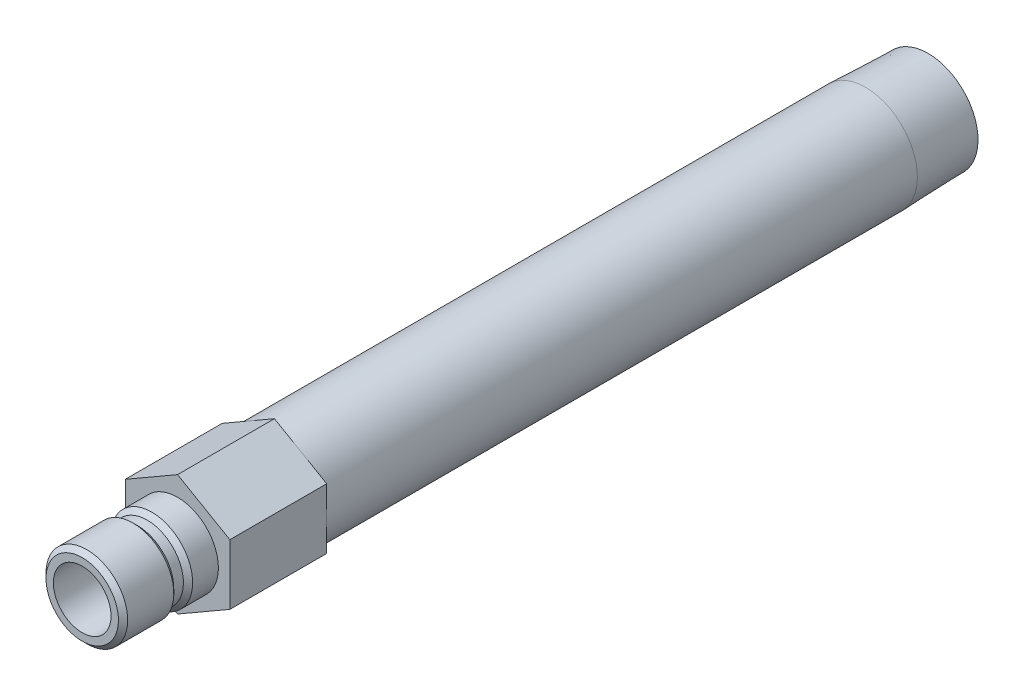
ISO-10303-21;
HEADER;
FILE_DESCRIPTION(('STEP AP214'),'2;1');
FILE_NAME('part.step','',(''),(''),'','','');
FILE_SCHEMA(('AUTOMOTIVE_DESIGN { 1 0 10303 214 1 1 1 1 }'));
ENDSEC;
DATA;
#1=APPLICATION_CONTEXT('core data for automotive mechanical design processes');
#2=APPLICATION_PROTOCOL_DEFINITION('international standard','automotive_design',2000,#1);
#3=PRODUCT_CONTEXT('',#1,'mechanical');
#4=PRODUCT('Part','Part','',(#3));
#5=PRODUCT_RELATED_PRODUCT_CATEGORY('part','',(#4));
#6=PRODUCT_DEFINITION_FORMATION('','',#4);
#7=PRODUCT_DEFINITION_CONTEXT('part definition',#1,'design');
#8=PRODUCT_DEFINITION('design','',#6,#7);
#9=PRODUCT_DEFINITION_SHAPE('','',#8);
#10=(LENGTH_UNIT() NAMED_UNIT(*) SI_UNIT(.MILLI.,.METRE.));
#11=(NAMED_UNIT(*) PLANE_ANGLE_UNIT() SI_UNIT($,.RADIAN.));
#12=(NAMED_UNIT(*) SI_UNIT($,.STERADIAN.) SOLID_ANGLE_UNIT());
#13=UNCERTAINTY_MEASURE_WITH_UNIT(LENGTH_MEASURE(1.E-05),#10,'distance_accuracy_value','');
#14=(GEOMETRIC_REPRESENTATION_CONTEXT(3) GLOBAL_UNCERTAINTY_ASSIGNED_CONTEXT((#13)) GLOBAL_UNIT_ASSIGNED_CONTEXT((#10,
#11,#12)) REPRESENTATION_CONTEXT('',''));
#15=CARTESIAN_POINT('',(0.,0.,0.));
#16=DIRECTION('',(0.,0.,1.));
#17=DIRECTION('',(1.,0.,0.));
#18=AXIS2_PLACEMENT_3D('',#15,#16,#17);
#19=CARTESIAN_POINT('',(0.,0.,0.));
#20=DIRECTION('',(0.,0.,-1.));
#21=DIRECTION('',(0.,1.,0.));
#22=AXIS2_PLACEMENT_3D('',#19,#20,#21);
#23=CYLINDRICAL_SURFACE('',#22,8.57249999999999);
#24=CARTESIAN_POINT('',(0.,0.,-113.6142));
#25=DIRECTION('',(0.,0.,-1.));
#26=DIRECTION('',(0.,1.,0.));
#27=AXIS2_PLACEMENT_3D('',#24,#25,#26);
#28=CIRCLE('',#27,8.57249999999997);
#29=CARTESIAN_POINT('',(0.,8.5725,-113.6142));
#30=VERTEX_POINT('',#29);
#31=EDGE_CURVE('E168',#30,#30,#28,.T.);
#32=ORIENTED_EDGE('',*,*,#31,.F.);
#33=EDGE_LOOP('',(#32));
#34=FACE_BOUND('',#33,.T.);
#35=CARTESIAN_POINT('',(0.,0.,-16.002));
#36=DIRECTION('',(0.,0.,1.));
#37=DIRECTION('',(1.,0.,0.));
#38=AXIS2_PLACEMENT_3D('',#35,#36,#37);
#39=CIRCLE('',#38,8.57249999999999);
#40=CARTESIAN_POINT('',(8.57249999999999,0.,-16.002));
#41=VERTEX_POINT('',#40);
#42=EDGE_CURVE('E37',#41,#41,#39,.F.);
#43=ORIENTED_EDGE('',*,*,#42,.T.);
#44=EDGE_LOOP('',(#43));
#45=FACE_BOUND('',#44,.T.);
#46=ADVANCED_FACE('F33',(#34,#45),#23,.T.);
#47=CARTESIAN_POINT('',(0.,0.,0.));
#48=DIRECTION('',(0.,0.,-1.));
#49=DIRECTION('',(0.,1.,0.));
#50=AXIS2_PLACEMENT_3D('',#47,#48,#49);
#51=CYLINDRICAL_SURFACE('',#50,4.7625);
#52=CARTESIAN_POINT('',(0.,0.,15.748));
#53=DIRECTION('',(0.,0.,-1.));
#54=DIRECTION('',(0.,1.,0.));
#55=AXIS2_PLACEMENT_3D('',#52,#53,#54);
#56=CIRCLE('',#55,4.7625);
#57=CARTESIAN_POINT('',(0.,4.7625,15.748));
#58=VERTEX_POINT('',#57);
#59=EDGE_CURVE('E144',#58,#58,#56,.T.);
#60=ORIENTED_EDGE('',*,*,#59,.F.);
#61=EDGE_LOOP('',(#60));
#62=FACE_BOUND('',#61,.T.);
#63=CARTESIAN_POINT('',(0.,0.,-16.002));
#64=DIRECTION('',(0.,0.,-1.));
#65=DIRECTION('',(0.,1.,0.));
#66=AXIS2_PLACEMENT_3D('',#63,#64,#65);
#67=CIRCLE('',#66,4.76249999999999);
#68=CARTESIAN_POINT('',(0.,4.7625,-16.002));
#69=VERTEX_POINT('',#68);
#70=EDGE_CURVE('E11',#69,#69,#67,.T.);
#71=ORIENTED_EDGE('',*,*,#70,.T.);
#72=EDGE_LOOP('',(#71));
#73=FACE_BOUND('',#72,.T.);
#74=ADVANCED_FACE('F35',(#62,#73),#51,.F.);
#75=CARTESIAN_POINT('',(0.,4.7625,-16.002));
#76=DIRECTION('',(0.,0.,-1.));
#77=DIRECTION('',(0.,1.,0.));
#78=AXIS2_PLACEMENT_3D('',#75,#76,#77);
#79=PLANE('',#78);
#80=CARTESIAN_POINT('',(0.,0.,-16.002));
#81=DIRECTION('',(0.,0.,-1.));
#82=DIRECTION('',(0.,1.,0.));
#83=AXIS2_PLACEMENT_3D('',#80,#81,#82);
#84=CIRCLE('',#83,6.26109999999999);
#85=CARTESIAN_POINT('',(0.,6.2611,-16.002));
#86=VERTEX_POINT('',#85);
#87=EDGE_CURVE('E43',#86,#86,#84,.T.);
#88=ORIENTED_EDGE('',*,*,#87,.T.);
#89=EDGE_LOOP('',(#88));
#90=FACE_BOUND('',#89,.T.);
#91=ORIENTED_EDGE('',*,*,#70,.F.);
#92=EDGE_LOOP('',(#91));
#93=FACE_BOUND('',#92,.T.);
#94=ADVANCED_FACE('F180',(#90,#93),#79,.T.);
#95=CARTESIAN_POINT('',(0.,0.,0.));
#96=DIRECTION('',(0.,0.,-1.));
#97=DIRECTION('',(0.,1.,0.));
#98=AXIS2_PLACEMENT_3D('',#95,#96,#97);
#99=CYLINDRICAL_SURFACE('',#98,6.26109999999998);
#100=CARTESIAN_POINT('',(0.,0.,-123.952));
#101=DIRECTION('',(0.,0.,-1.));
#102=DIRECTION('',(0.,1.,0.));
#103=AXIS2_PLACEMENT_3D('',#100,#101,#102);
#104=CIRCLE('',#103,6.26109999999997);
#105=CARTESIAN_POINT('',(0.,6.2611,-123.952));
#106=VERTEX_POINT('',#105);
#107=EDGE_CURVE('E174',#106,#106,#104,.T.);
#108=ORIENTED_EDGE('',*,*,#107,.T.);
#109=EDGE_LOOP('',(#108));
#110=FACE_BOUND('',#109,.T.);
#111=ORIENTED_EDGE('',*,*,#87,.F.);
#112=EDGE_LOOP('',(#111));
#113=FACE_BOUND('',#112,.T.);
#114=ADVANCED_FACE('F183',(#110,#113),#99,.F.);
#115=CARTESIAN_POINT('',(0.,8.24944566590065,-123.952));
#116=DIRECTION('',(0.,0.,-1.));
#117=DIRECTION('',(0.,1.,0.));
#118=AXIS2_PLACEMENT_3D('',#115,#116,#117);
#119=PLANE('',#118);
#120=CARTESIAN_POINT('',(0.,0.,-123.952));
#121=DIRECTION('',(0.,0.,-1.));
#122=DIRECTION('',(0.,1.,0.));
#123=AXIS2_PLACEMENT_3D('',#120,#121,#122);
#124=CIRCLE('',#123,8.24944566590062);
#125=CARTESIAN_POINT('',(0.,8.24944566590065,-123.952));
#126=VERTEX_POINT('',#125);
#127=EDGE_CURVE('E171',#126,#126,#124,.T.);
#128=ORIENTED_EDGE('',*,*,#127,.T.);
#129=EDGE_LOOP('',(#128));
#130=FACE_BOUND('',#129,.T.);
#131=ORIENTED_EDGE('',*,*,#107,.F.);
#132=EDGE_LOOP('',(#131));
#133=FACE_BOUND('',#132,.T.);
#134=ADVANCED_FACE('F185',(#130,#133),#119,.T.);
#135=CARTESIAN_POINT('',(0.,0.,-123.952));
#136=DIRECTION('',(0.,0.,1.));
#137=DIRECTION('',(0.,-1.,0.));
#138=AXIS2_PLACEMENT_3D('',#135,#136,#137);
#139=CONICAL_SURFACE('',#138,8.24944566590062,0.0312396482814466);
#140=ORIENTED_EDGE('',*,*,#31,.T.);
#141=EDGE_LOOP('',(#140));
#142=FACE_BOUND('',#141,.T.);
#143=ORIENTED_EDGE('',*,*,#127,.F.);
#144=EDGE_LOOP('',(#143));
#145=FACE_BOUND('',#144,.T.);
#146=ADVANCED_FACE('F192',(#142,#145),#139,.T.);
#147=CARTESIAN_POINT('',(0.,6.7437,0.));
#148=DIRECTION('',(0.,0.,1.));
#149=DIRECTION('',(0.,-1.,0.));
#150=AXIS2_PLACEMENT_3D('',#147,#148,#149);
#151=PLANE('',#150);
#152=CARTESIAN_POINT('',(0.,0.,0.));
#153=DIRECTION('',(0.,0.,-1.));
#154=DIRECTION('',(0.,1.,0.));
#155=AXIS2_PLACEMENT_3D('',#152,#153,#154);
#156=CIRCLE('',#155,6.7437);
#157=CARTESIAN_POINT('',(0.,6.7437,0.));
#158=VERTEX_POINT('',#157);
#159=EDGE_CURVE('E165',#158,#158,#156,.T.);
#160=ORIENTED_EDGE('',*,*,#159,.T.);
#161=EDGE_LOOP('',(#160));
#162=FACE_BOUND('',#161,.T.);
#163=DIRECTION('',(-0.866025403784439,-0.5,0.));
#164=VECTOR('',#163,1.);
#165=CARTESIAN_POINT('',(0.,9.97199384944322,0.));
#166=LINE('',#165,#164);
#167=CARTESIAN_POINT('',(0.,9.97199384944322,0.));
#168=VERTEX_POINT('',#167);
#169=CARTESIAN_POINT('',(-8.636,4.98599692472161,0.));
#170=VERTEX_POINT('',#169);
#171=EDGE_CURVE('E122',#168,#170,#166,.T.);
#172=ORIENTED_EDGE('',*,*,#171,.T.);
#173=DIRECTION('',(0.,-1.,0.));
#174=VECTOR('',#173,1.);
#175=CARTESIAN_POINT('',(-8.636,4.98599692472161,0.));
#176=LINE('',#175,#174);
#177=CARTESIAN_POINT('',(-8.636,-4.98599692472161,0.));
#178=VERTEX_POINT('',#177);
#179=EDGE_CURVE('E125',#170,#178,#176,.T.);
#180=ORIENTED_EDGE('',*,*,#179,.T.);
#181=DIRECTION('',(0.866025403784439,-0.5,0.));
#182=VECTOR('',#181,1.);
#183=CARTESIAN_POINT('',(-8.636,-4.98599692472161,0.));
#184=LINE('',#183,#182);
#185=CARTESIAN_POINT('',(0.,-9.97199384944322,0.));
#186=VERTEX_POINT('',#185);
#187=EDGE_CURVE('E128',#178,#186,#184,.T.);
#188=ORIENTED_EDGE('',*,*,#187,.T.);
#189=DIRECTION('',(0.866025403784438,0.5,0.));
#190=VECTOR('',#189,1.);
#191=CARTESIAN_POINT('',(0.,-9.97199384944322,0.));
#192=LINE('',#191,#190);
#193=CARTESIAN_POINT('',(8.63599999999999,-4.98599692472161,0.));
#194=VERTEX_POINT('',#193);
#195=EDGE_CURVE('E131',#186,#194,#192,.T.);
#196=ORIENTED_EDGE('',*,*,#195,.T.);
#197=DIRECTION('',(0.,1.,0.));
#198=VECTOR('',#197,1.);
#199=CARTESIAN_POINT('',(8.63599999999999,-4.98599692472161,0.));
#200=LINE('',#199,#198);
#201=CARTESIAN_POINT('',(8.636,4.98599692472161,0.));
#202=VERTEX_POINT('',#201);
#203=EDGE_CURVE('E99',#194,#202,#200,.T.);
#204=ORIENTED_EDGE('',*,*,#203,.T.);
#205=DIRECTION('',(-0.866025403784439,0.5,0.));
#206=VECTOR('',#205,1.);
#207=CARTESIAN_POINT('',(8.636,4.98599692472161,0.));
#208=LINE('',#207,#206);
#209=EDGE_CURVE('E134',#202,#168,#208,.T.);
#210=ORIENTED_EDGE('',*,*,#209,.T.);
#211=EDGE_LOOP('',(#172,#180,#188,#196,#204,#210));
#212=FACE_BOUND('',#211,.T.);
#213=ADVANCED_FACE('F206',(#162,#212),#151,.T.);
#214=CARTESIAN_POINT('',(0.,0.,0.));
#215=DIRECTION('',(0.,0.,-1.));
#216=DIRECTION('',(0.,1.,0.));
#217=AXIS2_PLACEMENT_3D('',#214,#215,#216);
#218=CYLINDRICAL_SURFACE('',#217,6.7437);
#219=CARTESIAN_POINT('',(0.,0.,4.25449999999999));
#220=DIRECTION('',(0.,0.,-1.));
#221=DIRECTION('',(0.,1.,0.));
#222=AXIS2_PLACEMENT_3D('',#219,#220,#221);
#223=CIRCLE('',#222,6.7437);
#224=CARTESIAN_POINT('',(0.,6.7437,4.2545));
#225=VERTEX_POINT('',#224);
#226=EDGE_CURVE('E162',#225,#225,#223,.T.);
#227=ORIENTED_EDGE('',*,*,#226,.T.);
#228=EDGE_LOOP('',(#227));
#229=FACE_BOUND('',#228,.T.);
#230=ORIENTED_EDGE('',*,*,#159,.F.);
#231=EDGE_LOOP('',(#230));
#232=FACE_BOUND('',#231,.T.);
#233=ADVANCED_FACE('F213',(#229,#232),#218,.T.);
#234=CARTESIAN_POINT('',(0.,0.,4.25449999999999));
#235=DIRECTION('',(0.,0.,-1.));
#236=DIRECTION('',(0.,1.,0.));
#237=AXIS2_PLACEMENT_3D('',#234,#235,#236);
#238=CONICAL_SURFACE('',#237,6.7437,0.785398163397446);
#239=CARTESIAN_POINT('',(0.,0.,5.0165));
#240=DIRECTION('',(0.,0.,-1.));
#241=DIRECTION('',(0.,1.,0.));
#242=AXIS2_PLACEMENT_3D('',#239,#240,#241);
#243=CIRCLE('',#242,5.9817);
#244=CARTESIAN_POINT('',(0.,5.9817,5.0165));
#245=VERTEX_POINT('',#244);
#246=EDGE_CURVE('E159',#245,#245,#243,.T.);
#247=ORIENTED_EDGE('',*,*,#246,.T.);
#248=EDGE_LOOP('',(#247));
#249=FACE_BOUND('',#248,.T.);
#250=ORIENTED_EDGE('',*,*,#226,.F.);
#251=EDGE_LOOP('',(#250));
#252=FACE_BOUND('',#251,.T.);
#253=ADVANCED_FACE('F222',(#249,#252),#238,.T.);
#254=CARTESIAN_POINT('',(0.,0.,0.));
#255=DIRECTION('',(0.,0.,-1.));
#256=DIRECTION('',(0.,1.,0.));
#257=AXIS2_PLACEMENT_3D('',#254,#255,#256);
#258=CYLINDRICAL_SURFACE('',#257,5.9817);
#259=CARTESIAN_POINT('',(0.,0.,6.604));
#260=DIRECTION('',(0.,0.,-1.));
#261=DIRECTION('',(0.,1.,0.));
#262=AXIS2_PLACEMENT_3D('',#259,#260,#261);
#263=CIRCLE('',#262,5.9817);
#264=CARTESIAN_POINT('',(0.,5.9817,6.604));
#265=VERTEX_POINT('',#264);
#266=EDGE_CURVE('E156',#265,#265,#263,.T.);
#267=ORIENTED_EDGE('',*,*,#266,.T.);
#268=EDGE_LOOP('',(#267));
#269=FACE_BOUND('',#268,.T.);
#270=ORIENTED_EDGE('',*,*,#246,.F.);
#271=EDGE_LOOP('',(#270));
#272=FACE_BOUND('',#271,.T.);
#273=ADVANCED_FACE('F263',(#269,#272),#258,.T.);
#274=CARTESIAN_POINT('',(0.,0.,6.604));
#275=DIRECTION('',(0.,0.,1.));
#276=DIRECTION('',(0.,-1.,0.));
#277=AXIS2_PLACEMENT_3D('',#274,#275,#276);
#278=CONICAL_SURFACE('',#277,5.9817,0.785398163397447);
#279=CARTESIAN_POINT('',(0.,0.,7.366));
#280=DIRECTION('',(0.,0.,-1.));
#281=DIRECTION('',(0.,1.,0.));
#282=AXIS2_PLACEMENT_3D('',#279,#280,#281);
#283=CIRCLE('',#282,6.7437);
#284=CARTESIAN_POINT('',(0.,6.7437,7.366));
#285=VERTEX_POINT('',#284);
#286=EDGE_CURVE('E153',#285,#285,#283,.T.);
#287=ORIENTED_EDGE('',*,*,#286,.T.);
#288=EDGE_LOOP('',(#287));
#289=FACE_BOUND('',#288,.T.);
#290=ORIENTED_EDGE('',*,*,#266,.F.);
#291=EDGE_LOOP('',(#290));
#292=FACE_BOUND('',#291,.T.);
#293=ADVANCED_FACE('F259',(#289,#292),#278,.T.);
#294=CARTESIAN_POINT('',(0.,0.,0.));
#295=DIRECTION('',(0.,0.,-1.));
#296=DIRECTION('',(0.,1.,0.));
#297=AXIS2_PLACEMENT_3D('',#294,#295,#296);
#298=CYLINDRICAL_SURFACE('',#297,6.7437);
#299=CARTESIAN_POINT('',(0.,0.,14.986));
#300=DIRECTION('',(0.,0.,-1.));
#301=DIRECTION('',(0.,1.,0.));
#302=AXIS2_PLACEMENT_3D('',#299,#300,#301);
#303=CIRCLE('',#302,6.7437);
#304=CARTESIAN_POINT('',(0.,6.7437,14.986));
#305=VERTEX_POINT('',#304);
#306=EDGE_CURVE('E150',#305,#305,#303,.T.);
#307=ORIENTED_EDGE('',*,*,#306,.T.);
#308=EDGE_LOOP('',(#307));
#309=FACE_BOUND('',#308,.T.);
#310=ORIENTED_EDGE('',*,*,#286,.F.);
#311=EDGE_LOOP('',(#310));
#312=FACE_BOUND('',#311,.T.);
#313=ADVANCED_FACE('F255',(#309,#312),#298,.T.);
#314=CARTESIAN_POINT('',(0.,0.,14.986));
#315=DIRECTION('',(0.,0.,-1.));
#316=DIRECTION('',(0.,1.,0.));
#317=AXIS2_PLACEMENT_3D('',#314,#315,#316);
#318=CONICAL_SURFACE('',#317,6.7437,0.785398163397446);
#319=CARTESIAN_POINT('',(0.,0.,15.748));
#320=DIRECTION('',(0.,0.,-1.));
#321=DIRECTION('',(0.,1.,0.));
#322=AXIS2_PLACEMENT_3D('',#319,#320,#321);
#323=CIRCLE('',#322,5.9817);
#324=CARTESIAN_POINT('',(0.,5.9817,15.748));
#325=VERTEX_POINT('',#324);
#326=EDGE_CURVE('E147',#325,#325,#323,.T.);
#327=ORIENTED_EDGE('',*,*,#326,.T.);
#328=EDGE_LOOP('',(#327));
#329=FACE_BOUND('',#328,.T.);
#330=ORIENTED_EDGE('',*,*,#306,.F.);
#331=EDGE_LOOP('',(#330));
#332=FACE_BOUND('',#331,.T.);
#333=ADVANCED_FACE('F251',(#329,#332),#318,.T.);
#334=CARTESIAN_POINT('',(0.,4.7625,15.748));
#335=DIRECTION('',(0.,0.,1.));
#336=DIRECTION('',(0.,-1.,0.));
#337=AXIS2_PLACEMENT_3D('',#334,#335,#336);
#338=PLANE('',#337);
#339=ORIENTED_EDGE('',*,*,#59,.T.);
#340=EDGE_LOOP('',(#339));
#341=FACE_BOUND('',#340,.T.);
#342=ORIENTED_EDGE('',*,*,#326,.F.);
#343=EDGE_LOOP('',(#342));
#344=FACE_BOUND('',#343,.T.);
#345=ADVANCED_FACE('F239',(#341,#344),#338,.T.);
#346=CARTESIAN_POINT('',(0.,9.97199384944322,-16.002));
#347=DIRECTION('',(-0.5,0.866025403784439,0.));
#348=DIRECTION('',(-0.866025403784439,-0.5,0.));
#349=AXIS2_PLACEMENT_3D('',#346,#347,#348);
#350=PLANE('',#349);
#351=ORIENTED_EDGE('',*,*,#171,.F.);
#352=DIRECTION('',(0.,0.,1.));
#353=VECTOR('',#352,1.);
#354=CARTESIAN_POINT('',(0.,9.97199384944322,-16.002));
#355=LINE('',#354,#353);
#356=CARTESIAN_POINT('',(0.,9.97199384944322,-16.002));
#357=VERTEX_POINT('',#356);
#358=EDGE_CURVE('E51',#357,#168,#355,.T.);
#359=ORIENTED_EDGE('',*,*,#358,.F.);
#360=DIRECTION('',(-0.866025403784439,-0.5,0.));
#361=VECTOR('',#360,1.);
#362=CARTESIAN_POINT('',(0.,9.97199384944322,-16.002));
#363=LINE('',#362,#361);
#364=CARTESIAN_POINT('',(-8.636,4.98599692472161,-16.002));
#365=VERTEX_POINT('',#364);
#366=EDGE_CURVE('E137',#357,#365,#363,.T.);
#367=ORIENTED_EDGE('',*,*,#366,.T.);
#368=DIRECTION('',(0.,0.,1.));
#369=VECTOR('',#368,1.);
#370=CARTESIAN_POINT('',(-8.636,4.98599692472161,-16.002));
#371=LINE('',#370,#369);
#372=EDGE_CURVE('E86',#365,#170,#371,.T.);
#373=ORIENTED_EDGE('',*,*,#372,.T.);
#374=EDGE_LOOP('',(#351,#359,#367,#373));
#375=FACE_BOUND('',#374,.T.);
#376=ADVANCED_FACE('F226',(#375),#350,.T.);
#377=CARTESIAN_POINT('',(8.636,4.98599692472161,-16.002));
#378=DIRECTION('',(0.5,0.866025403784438,0.));
#379=DIRECTION('',(-0.866025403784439,0.5,0.));
#380=AXIS2_PLACEMENT_3D('',#377,#378,#379);
#381=PLANE('',#380);
#382=ORIENTED_EDGE('',*,*,#209,.F.);
#383=DIRECTION('',(0.,0.,1.));
#384=VECTOR('',#383,1.);
#385=CARTESIAN_POINT('',(8.636,4.98599692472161,-16.002));
#386=LINE('',#385,#384);
#387=CARTESIAN_POINT('',(8.636,4.98599692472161,-16.002));
#388=VERTEX_POINT('',#387);
#389=EDGE_CURVE('E74',#388,#202,#386,.T.);
#390=ORIENTED_EDGE('',*,*,#389,.F.);
#391=DIRECTION('',(-0.866025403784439,0.5,0.));
#392=VECTOR('',#391,1.);
#393=CARTESIAN_POINT('',(8.636,4.98599692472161,-16.002));
#394=LINE('',#393,#392);
#395=EDGE_CURVE('E112',#388,#357,#394,.T.);
#396=ORIENTED_EDGE('',*,*,#395,.T.);
#397=ORIENTED_EDGE('',*,*,#358,.T.);
#398=EDGE_LOOP('',(#382,#390,#396,#397));
#399=FACE_BOUND('',#398,.T.);
#400=ADVANCED_FACE('F231',(#399),#381,.T.);
#401=CARTESIAN_POINT('',(8.63599999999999,-4.98599692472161,-16.002));
#402=DIRECTION('',(1.,0.,0.));
#403=DIRECTION('',(0.,1.,0.));
#404=AXIS2_PLACEMENT_3D('',#401,#402,#403);
#405=PLANE('',#404);
#406=ORIENTED_EDGE('',*,*,#203,.F.);
#407=DIRECTION('',(0.,0.,1.));
#408=VECTOR('',#407,1.);
#409=CARTESIAN_POINT('',(8.63599999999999,-4.98599692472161,-16.002));
#410=LINE('',#409,#408);
#411=CARTESIAN_POINT('',(8.63599999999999,-4.98599692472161,-16.002));
#412=VERTEX_POINT('',#411);
#413=EDGE_CURVE('E94',#412,#194,#410,.T.);
#414=ORIENTED_EDGE('',*,*,#413,.F.);
#415=DIRECTION('',(0.,1.,0.));
#416=VECTOR('',#415,1.);
#417=CARTESIAN_POINT('',(8.63599999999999,-4.98599692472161,-16.002));
#418=LINE('',#417,#416);
#419=EDGE_CURVE('E97',#412,#388,#418,.T.);
#420=ORIENTED_EDGE('',*,*,#419,.T.);
#421=ORIENTED_EDGE('',*,*,#389,.T.);
#422=EDGE_LOOP('',(#406,#414,#420,#421));
#423=FACE_BOUND('',#422,.T.);
#424=ADVANCED_FACE('F96',(#423),#405,.T.);
#425=CARTESIAN_POINT('',(0.,-9.97199384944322,-16.002));
#426=DIRECTION('',(0.5,-0.866025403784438,0.));
#427=DIRECTION('',(0.866025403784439,0.5,0.));
#428=AXIS2_PLACEMENT_3D('',#425,#426,#427);
#429=PLANE('',#428);
#430=ORIENTED_EDGE('',*,*,#195,.F.);
#431=DIRECTION('',(0.,0.,1.));
#432=VECTOR('',#431,1.);
#433=CARTESIAN_POINT('',(0.,-9.97199384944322,-16.002));
#434=LINE('',#433,#432);
#435=CARTESIAN_POINT('',(0.,-9.97199384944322,-16.002));
#436=VERTEX_POINT('',#435);
#437=EDGE_CURVE('E104',#436,#186,#434,.T.);
#438=ORIENTED_EDGE('',*,*,#437,.F.);
#439=DIRECTION('',(0.866025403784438,0.5,0.));
#440=VECTOR('',#439,1.);
#441=CARTESIAN_POINT('',(0.,-9.97199384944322,-16.002));
#442=LINE('',#441,#440);
#443=EDGE_CURVE('E110',#436,#412,#442,.T.);
#444=ORIENTED_EDGE('',*,*,#443,.T.);
#445=ORIENTED_EDGE('',*,*,#413,.T.);
#446=EDGE_LOOP('',(#430,#438,#444,#445));
#447=FACE_BOUND('',#446,.T.);
#448=ADVANCED_FACE('F114',(#447),#429,.T.);
#449=CARTESIAN_POINT('',(-8.636,-4.98599692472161,-16.002));
#450=DIRECTION('',(-0.5,-0.866025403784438,0.));
#451=DIRECTION('',(0.866025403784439,-0.5,0.));
#452=AXIS2_PLACEMENT_3D('',#449,#450,#451);
#453=PLANE('',#452);
#454=ORIENTED_EDGE('',*,*,#187,.F.);
#455=DIRECTION('',(0.,0.,1.));
#456=VECTOR('',#455,1.);
#457=CARTESIAN_POINT('',(-8.636,-4.98599692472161,-16.002));
#458=LINE('',#457,#456);
#459=CARTESIAN_POINT('',(-8.636,-4.98599692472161,-16.002));
#460=VERTEX_POINT('',#459);
#461=EDGE_CURVE('E141',#460,#178,#458,.T.);
#462=ORIENTED_EDGE('',*,*,#461,.F.);
#463=DIRECTION('',(0.866025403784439,-0.5,0.));
#464=VECTOR('',#463,1.);
#465=CARTESIAN_POINT('',(-8.636,-4.98599692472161,-16.002));
#466=LINE('',#465,#464);
#467=EDGE_CURVE('E115',#460,#436,#466,.T.);
#468=ORIENTED_EDGE('',*,*,#467,.T.);
#469=ORIENTED_EDGE('',*,*,#437,.T.);
#470=EDGE_LOOP('',(#454,#462,#468,#469));
#471=FACE_BOUND('',#470,.T.);
#472=ADVANCED_FACE('F230',(#471),#453,.T.);
#473=CARTESIAN_POINT('',(-8.636,4.98599692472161,-16.002));
#474=DIRECTION('',(-1.,0.,0.));
#475=DIRECTION('',(0.,0.,1.));
#476=AXIS2_PLACEMENT_3D('',#473,#474,#475);
#477=PLANE('',#476);
#478=ORIENTED_EDGE('',*,*,#179,.F.);
#479=ORIENTED_EDGE('',*,*,#372,.F.);
#480=DIRECTION('',(0.,-1.,0.));
#481=VECTOR('',#480,1.);
#482=CARTESIAN_POINT('',(-8.636,4.98599692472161,-16.002));
#483=LINE('',#482,#481);
#484=EDGE_CURVE('E117',#365,#460,#483,.T.);
#485=ORIENTED_EDGE('',*,*,#484,.T.);
#486=ORIENTED_EDGE('',*,*,#461,.T.);
#487=EDGE_LOOP('',(#478,#479,#485,#486));
#488=FACE_BOUND('',#487,.T.);
#489=ADVANCED_FACE('F227',(#488),#477,.T.);
#490=CARTESIAN_POINT('',(-8.636,4.98599692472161,-16.002));
#491=DIRECTION('',(0.,0.,1.));
#492=DIRECTION('',(1.,0.,0.));
#493=AXIS2_PLACEMENT_3D('',#490,#491,#492);
#494=PLANE('',#493);
#495=ORIENTED_EDGE('',*,*,#42,.F.);
#496=EDGE_LOOP('',(#495));
#497=FACE_BOUND('',#496,.T.);
#498=ORIENTED_EDGE('',*,*,#366,.F.);
#499=ORIENTED_EDGE('',*,*,#395,.F.);
#500=ORIENTED_EDGE('',*,*,#419,.F.);
#501=ORIENTED_EDGE('',*,*,#443,.F.);
#502=ORIENTED_EDGE('',*,*,#467,.F.);
#503=ORIENTED_EDGE('',*,*,#484,.F.);
#504=EDGE_LOOP('',(#498,#499,#500,#501,#502,#503));
#505=FACE_BOUND('',#504,.T.);
#506=ADVANCED_FACE('F108',(#497,#505),#494,.F.);
#507=CLOSED_SHELL('',(#46,#74,#94,#114,#134,#146,#213,#233,#253,#273,#293,#313,#333,#345,#376,
#400,#424,#448,#472,#489,#506));
#508=MANIFOLD_SOLID_BREP('B2',#507);
#509=ADVANCED_BREP_SHAPE_REPRESENTATION('',(#18,#508),#14);
#510=SHAPE_DEFINITION_REPRESENTATION(#9,#509);
ENDSEC;
END-ISO-10303-21;
